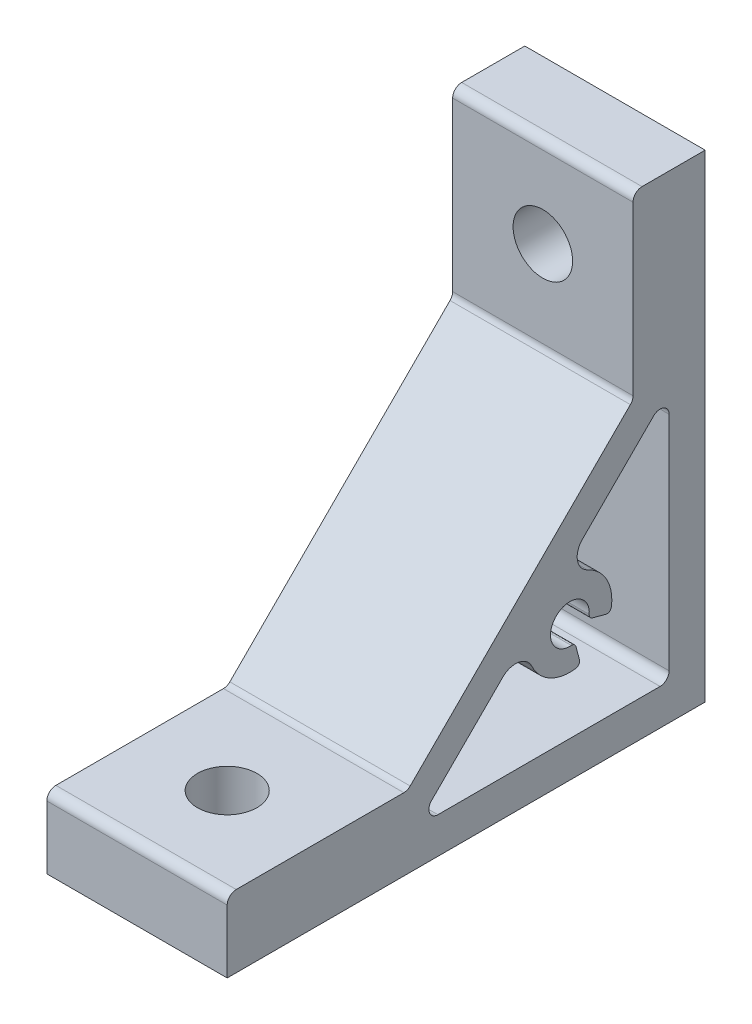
ISO-10303-21;
HEADER;
FILE_DESCRIPTION(('STEP AP214'),'2;1');
FILE_NAME('part.step','',(''),(''),'','','');
FILE_SCHEMA(('AUTOMOTIVE_DESIGN { 1 0 10303 214 1 1 1 1 }'));
ENDSEC;
DATA;
#1=APPLICATION_CONTEXT('core data for automotive mechanical design processes');
#2=APPLICATION_PROTOCOL_DEFINITION('international standard','automotive_design',2000,#1);
#3=PRODUCT_CONTEXT('',#1,'mechanical');
#4=PRODUCT('Part','Part','',(#3));
#5=PRODUCT_RELATED_PRODUCT_CATEGORY('part','',(#4));
#6=PRODUCT_DEFINITION_FORMATION('','',#4);
#7=PRODUCT_DEFINITION_CONTEXT('part definition',#1,'design');
#8=PRODUCT_DEFINITION('design','',#6,#7);
#9=PRODUCT_DEFINITION_SHAPE('','',#8);
#10=(LENGTH_UNIT() NAMED_UNIT(*) SI_UNIT(.MILLI.,.METRE.));
#11=(NAMED_UNIT(*) PLANE_ANGLE_UNIT() SI_UNIT($,.RADIAN.));
#12=(NAMED_UNIT(*) SI_UNIT($,.STERADIAN.) SOLID_ANGLE_UNIT());
#13=UNCERTAINTY_MEASURE_WITH_UNIT(LENGTH_MEASURE(1.E-05),#10,'distance_accuracy_value','');
#14=(GEOMETRIC_REPRESENTATION_CONTEXT(3) GLOBAL_UNCERTAINTY_ASSIGNED_CONTEXT((#13)) GLOBAL_UNIT_ASSIGNED_CONTEXT((#10,
#11,#12)) REPRESENTATION_CONTEXT('',''));
#15=CARTESIAN_POINT('',(0.,0.,0.));
#16=DIRECTION('',(0.,0.,1.));
#17=DIRECTION('',(1.,0.,0.));
#18=AXIS2_PLACEMENT_3D('',#15,#16,#17);
#19=CARTESIAN_POINT('',(10.,51.9999999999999,6.99999999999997));
#20=DIRECTION('',(1.,0.,0.));
#21=DIRECTION('',(0.,0.,-1.));
#22=AXIS2_PLACEMENT_3D('',#19,#20,#21);
#23=PLANE('',#22);
#24=DIRECTION('',(0.,0.,-1.));
#25=VECTOR('',#24,1.);
#26=CARTESIAN_POINT('',(10.,0.,53.));
#27=LINE('',#26,#25);
#28=CARTESIAN_POINT('',(10.,0.,53.));
#29=VERTEX_POINT('',#28);
#30=CARTESIAN_POINT('',(10.,0.,0.));
#31=VERTEX_POINT('',#30);
#32=EDGE_CURVE('E372',#29,#31,#27,.T.);
#33=ORIENTED_EDGE('',*,*,#32,.T.);
#34=DIRECTION('',(0.,1.,0.));
#35=VECTOR('',#34,1.);
#36=CARTESIAN_POINT('',(10.,0.,0.));
#37=LINE('',#36,#35);
#38=CARTESIAN_POINT('',(10.,53.,0.));
#39=VERTEX_POINT('',#38);
#40=EDGE_CURVE('E375',#31,#39,#37,.T.);
#41=ORIENTED_EDGE('',*,*,#40,.T.);
#42=DIRECTION('',(0.,0.,1.));
#43=VECTOR('',#42,1.);
#44=CARTESIAN_POINT('',(10.,52.9999999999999,6.99999999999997));
#45=LINE('',#44,#43);
#46=CARTESIAN_POINT('',(10.,52.9999999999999,6.99999999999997));
#47=VERTEX_POINT('',#46);
#48=EDGE_CURVE('E378',#39,#47,#45,.T.);
#49=ORIENTED_EDGE('',*,*,#48,.T.);
#50=CARTESIAN_POINT('',(10.,51.9999999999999,6.99999999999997));
#51=DIRECTION('',(1.,0.,0.));
#52=DIRECTION('',(0.,0.,-1.));
#53=AXIS2_PLACEMENT_3D('',#50,#51,#52);
#54=CIRCLE('',#53,1.);
#55=CARTESIAN_POINT('',(10.,51.9999999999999,7.99999999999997));
#56=VERTEX_POINT('',#55);
#57=EDGE_CURVE('E380',#47,#56,#54,.T.);
#58=ORIENTED_EDGE('',*,*,#57,.T.);
#59=DIRECTION('',(0.,-1.,0.));
#60=VECTOR('',#59,1.);
#61=CARTESIAN_POINT('',(10.,33.4142135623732,7.99999999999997));
#62=LINE('',#61,#60);
#63=CARTESIAN_POINT('',(10.,33.4142135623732,7.99999999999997));
#64=VERTEX_POINT('',#63);
#65=EDGE_CURVE('E382',#56,#64,#62,.T.);
#66=ORIENTED_EDGE('',*,*,#65,.T.);
#67=CARTESIAN_POINT('',(10.,33.4142135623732,8.99999999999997));
#68=DIRECTION('',(-1.,0.,0.));
#69=DIRECTION('',(0.,0.,-1.));
#70=AXIS2_PLACEMENT_3D('',#67,#68,#69);
#71=CIRCLE('',#70,1.);
#72=CARTESIAN_POINT('',(10.,32.7071067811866,8.29289321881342));
#73=VERTEX_POINT('',#72);
#74=EDGE_CURVE('E384',#64,#73,#71,.T.);
#75=ORIENTED_EDGE('',*,*,#74,.T.);
#76=DIRECTION('',(0.,-0.707106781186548,0.707106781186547));
#77=VECTOR('',#76,1.);
#78=CARTESIAN_POINT('',(10.,32.7071067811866,8.29289321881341));
#79=LINE('',#78,#77);
#80=CARTESIAN_POINT('',(10.,8.29289321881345,32.7071067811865));
#81=VERTEX_POINT('',#80);
#82=EDGE_CURVE('E386',#73,#81,#79,.T.);
#83=ORIENTED_EDGE('',*,*,#82,.T.);
#84=CARTESIAN_POINT('',(10.,8.99999999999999,33.4142135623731));
#85=DIRECTION('',(-1.,0.,0.));
#86=DIRECTION('',(0.,0.,-1.));
#87=AXIS2_PLACEMENT_3D('',#84,#85,#86);
#88=CIRCLE('',#87,1.00000000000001);
#89=CARTESIAN_POINT('',(10.,7.99999999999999,33.4142135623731));
#90=VERTEX_POINT('',#89);
#91=EDGE_CURVE('E389',#81,#90,#88,.T.);
#92=ORIENTED_EDGE('',*,*,#91,.T.);
#93=DIRECTION('',(0.,0.,1.));
#94=VECTOR('',#93,1.);
#95=CARTESIAN_POINT('',(10.,7.99999999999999,52.));
#96=LINE('',#95,#94);
#97=CARTESIAN_POINT('',(10.,7.99999999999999,52.));
#98=VERTEX_POINT('',#97);
#99=EDGE_CURVE('E391',#90,#98,#96,.T.);
#100=ORIENTED_EDGE('',*,*,#99,.T.);
#101=CARTESIAN_POINT('',(10.,6.99999999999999,52.));
#102=DIRECTION('',(1.,0.,0.));
#103=DIRECTION('',(0.,0.,-1.));
#104=AXIS2_PLACEMENT_3D('',#101,#102,#103);
#105=CIRCLE('',#104,1.);
#106=CARTESIAN_POINT('',(10.,6.99999999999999,53.));
#107=VERTEX_POINT('',#106);
#108=EDGE_CURVE('E393',#98,#107,#105,.T.);
#109=ORIENTED_EDGE('',*,*,#108,.T.);
#110=DIRECTION('',(0.,-1.,0.));
#111=VECTOR('',#110,1.);
#112=CARTESIAN_POINT('',(10.,0.,53.));
#113=LINE('',#112,#111);
#114=EDGE_CURVE('E395',#107,#29,#113,.T.);
#115=ORIENTED_EDGE('',*,*,#114,.T.);
#116=EDGE_LOOP('',(#33,#41,#49,#58,#66,#75,#83,#92,#100,#109,#115));
#117=FACE_BOUND('',#116,.T.);
#118=DIRECTION('',(0.,1.,0.));
#119=VECTOR('',#118,1.);
#120=CARTESIAN_POINT('',(10.,4.99999999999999,3.99999999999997));
#121=LINE('',#120,#119);
#122=CARTESIAN_POINT('',(10.,4.99999999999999,3.99999999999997));
#123=VERTEX_POINT('',#122);
#124=CARTESIAN_POINT('',(10.,29.6360389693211,3.99999999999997));
#125=VERTEX_POINT('',#124);
#126=EDGE_CURVE('E243',#123,#125,#121,.T.);
#127=ORIENTED_EDGE('',*,*,#126,.F.);
#128=CARTESIAN_POINT('',(10.,4.99999999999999,4.99999999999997));
#129=DIRECTION('',(1.,0.,0.));
#130=DIRECTION('',(0.,0.,-1.));
#131=AXIS2_PLACEMENT_3D('',#128,#129,#130);
#132=CIRCLE('',#131,0.999999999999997);
#133=CARTESIAN_POINT('',(10.,4.,4.99999999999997));
#134=VERTEX_POINT('',#133);
#135=EDGE_CURVE('E235',#134,#123,#132,.T.);
#136=ORIENTED_EDGE('',*,*,#135,.F.);
#137=DIRECTION('',(0.,0.,-1.));
#138=VECTOR('',#137,1.);
#139=CARTESIAN_POINT('',(10.,4.,29.6360389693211));
#140=LINE('',#139,#138);
#141=CARTESIAN_POINT('',(10.,4.,29.6360389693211));
#142=VERTEX_POINT('',#141);
#143=EDGE_CURVE('E289',#142,#134,#140,.T.);
#144=ORIENTED_EDGE('',*,*,#143,.F.);
#145=CARTESIAN_POINT('',(10.,4.99999999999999,29.6360389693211));
#146=DIRECTION('',(1.,0.,0.));
#147=DIRECTION('',(0.,0.,-1.));
#148=AXIS2_PLACEMENT_3D('',#145,#146,#147);
#149=CIRCLE('',#148,0.99999999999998);
#150=CARTESIAN_POINT('',(10.,5.70710678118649,30.3431457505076));
#151=VERTEX_POINT('',#150);
#152=EDGE_CURVE('E287',#151,#142,#149,.T.);
#153=ORIENTED_EDGE('',*,*,#152,.F.);
#154=DIRECTION('',(0.,-0.707106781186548,0.707106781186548));
#155=VECTOR('',#154,1.);
#156=CARTESIAN_POINT('',(10.,13.6074107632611,22.442841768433));
#157=LINE('',#156,#155);
#158=CARTESIAN_POINT('',(10.,13.6074107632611,22.442841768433));
#159=VERTEX_POINT('',#158);
#160=EDGE_CURVE('E285',#159,#151,#157,.T.);
#161=ORIENTED_EDGE('',*,*,#160,.F.);
#162=CARTESIAN_POINT('',(10.,12.193197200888,21.0286282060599));
#163=DIRECTION('',(1.,0.,0.));
#164=DIRECTION('',(0.,0.,-1.));
#165=AXIS2_PLACEMENT_3D('',#162,#163,#164);
#166=CIRCLE('',#165,1.99999999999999);
#167=CARTESIAN_POINT('',(10.,13.0373484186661,19.2155069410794));
#168=VERTEX_POINT('',#167);
#169=EDGE_CURVE('E283',#168,#159,#166,.T.);
#170=ORIENTED_EDGE('',*,*,#169,.F.);
#171=CARTESIAN_POINT('',(10.,15.,15.));
#172=DIRECTION('',(-1.,0.,0.));
#173=DIRECTION('',(0.,0.,-1.));
#174=AXIS2_PLACEMENT_3D('',#171,#172,#173);
#175=CIRCLE('',#174,4.65000000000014);
#176=CARTESIAN_POINT('',(10.,10.3961625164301,14.3464095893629));
#177=VERTEX_POINT('',#176);
#178=EDGE_CURVE('E281',#177,#168,#175,.T.);
#179=ORIENTED_EDGE('',*,*,#178,.F.);
#180=CARTESIAN_POINT('',(10.,10.891198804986,14.4166881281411));
#181=DIRECTION('',(-1.,0.,0.));
#182=DIRECTION('',(0.,0.,-1.));
#183=AXIS2_PLACEMENT_3D('',#180,#181,#182);
#184=CIRCLE('',#183,0.500000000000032);
#185=CARTESIAN_POINT('',(10.,11.0206083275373,13.9337252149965));
#186=VERTEX_POINT('',#185);
#187=EDGE_CURVE('E279',#186,#177,#184,.T.);
#188=ORIENTED_EDGE('',*,*,#187,.F.);
#189=DIRECTION('',(0.,-0.965925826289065,-0.258819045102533));
#190=VECTOR('',#189,1.);
#191=CARTESIAN_POINT('',(10.,11.0206083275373,13.9337252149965));
#192=LINE('',#191,#190);
#193=CARTESIAN_POINT('',(10.,12.4862719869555,14.3264486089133));
#194=VERTEX_POINT('',#193);
#195=EDGE_CURVE('E277',#194,#186,#192,.T.);
#196=ORIENTED_EDGE('',*,*,#195,.F.);
#197=CARTESIAN_POINT('',(10.,12.3568624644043,14.8094115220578));
#198=DIRECTION('',(-1.,0.,0.));
#199=DIRECTION('',(0.,0.,-1.));
#200=AXIS2_PLACEMENT_3D('',#197,#198,#199);
#201=CIRCLE('',#200,0.499999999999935);
#202=CARTESIAN_POINT('',(10.,12.8555676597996,14.8453716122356));
#203=VERTEX_POINT('',#202);
#204=EDGE_CURVE('E275',#203,#194,#201,.T.);
#205=ORIENTED_EDGE('',*,*,#204,.F.);
#206=CARTESIAN_POINT('',(10.,15.,15.));
#207=DIRECTION('',(1.,0.,0.));
#208=DIRECTION('',(0.,0.,-1.));
#209=AXIS2_PLACEMENT_3D('',#206,#207,#208);
#210=CIRCLE('',#209,2.14999999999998);
#211=CARTESIAN_POINT('',(10.,14.8453716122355,12.8555676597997));
#212=VERTEX_POINT('',#211);
#213=EDGE_CURVE('E273',#212,#203,#210,.T.);
#214=ORIENTED_EDGE('',*,*,#213,.F.);
#215=CARTESIAN_POINT('',(10.,14.8094115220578,12.3568624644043));
#216=DIRECTION('',(-1.,0.,0.));
#217=DIRECTION('',(0.,0.,-1.));
#218=AXIS2_PLACEMENT_3D('',#215,#216,#217);
#219=CIRCLE('',#218,0.499999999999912);
#220=CARTESIAN_POINT('',(10.,14.3264486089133,12.4862719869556));
#221=VERTEX_POINT('',#220);
#222=EDGE_CURVE('E271',#221,#212,#219,.T.);
#223=ORIENTED_EDGE('',*,*,#222,.F.);
#224=DIRECTION('',(0.,0.2588190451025,0.965925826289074));
#225=VECTOR('',#224,1.);
#226=CARTESIAN_POINT('',(10.,13.9337252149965,11.0206083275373));
#227=LINE('',#226,#225);
#228=CARTESIAN_POINT('',(10.,13.9337252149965,11.0206083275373));
#229=VERTEX_POINT('',#228);
#230=EDGE_CURVE('E269',#229,#221,#227,.T.);
#231=ORIENTED_EDGE('',*,*,#230,.F.);
#232=CARTESIAN_POINT('',(10.,14.416688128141,10.891198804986));
#233=DIRECTION('',(-1.,0.,0.));
#234=DIRECTION('',(0.,0.,-1.));
#235=AXIS2_PLACEMENT_3D('',#232,#233,#234);
#236=CIRCLE('',#235,0.499999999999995);
#237=CARTESIAN_POINT('',(10.,14.3464095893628,10.3961625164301));
#238=VERTEX_POINT('',#237);
#239=EDGE_CURVE('E267',#238,#229,#236,.T.);
#240=ORIENTED_EDGE('',*,*,#239,.F.);
#241=CARTESIAN_POINT('',(10.,15.,15.));
#242=DIRECTION('',(-1.,0.,0.));
#243=DIRECTION('',(0.,0.,-1.));
#244=AXIS2_PLACEMENT_3D('',#241,#242,#243);
#245=CIRCLE('',#244,4.64999999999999);
#246=CARTESIAN_POINT('',(10.,19.2155069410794,13.0373484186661));
#247=VERTEX_POINT('',#246);
#248=EDGE_CURVE('E265',#247,#238,#245,.T.);
#249=ORIENTED_EDGE('',*,*,#248,.F.);
#250=CARTESIAN_POINT('',(10.,21.0286282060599,12.193197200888));
#251=DIRECTION('',(1.,0.,0.));
#252=DIRECTION('',(0.,0.,-1.));
#253=AXIS2_PLACEMENT_3D('',#250,#251,#252);
#254=CIRCLE('',#253,2.00000000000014);
#255=CARTESIAN_POINT('',(10.,22.442841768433,13.6074107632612));
#256=VERTEX_POINT('',#255);
#257=EDGE_CURVE('E263',#256,#247,#254,.T.);
#258=ORIENTED_EDGE('',*,*,#257,.F.);
#259=DIRECTION('',(0.,-0.707106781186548,0.707106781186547));
#260=VECTOR('',#259,1.);
#261=CARTESIAN_POINT('',(10.,30.3431457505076,5.70710678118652));
#262=LINE('',#261,#260);
#263=CARTESIAN_POINT('',(10.,30.3431457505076,5.70710678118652));
#264=VERTEX_POINT('',#263);
#265=EDGE_CURVE('E258',#264,#256,#262,.T.);
#266=ORIENTED_EDGE('',*,*,#265,.F.);
#267=CARTESIAN_POINT('',(10.,29.6360389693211,4.99999999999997));
#268=DIRECTION('',(1.,0.,0.));
#269=DIRECTION('',(0.,0.,-1.));
#270=AXIS2_PLACEMENT_3D('',#267,#268,#269);
#271=CIRCLE('',#270,1.00000000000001);
#272=EDGE_CURVE('E256',#125,#264,#271,.T.);
#273=ORIENTED_EDGE('',*,*,#272,.F.);
#274=EDGE_LOOP('',(#127,#136,#144,#153,#161,#170,#179,#188,#196,#205,#214,#223,#231,#240,#249,
#258,#266,#273));
#275=FACE_BOUND('',#274,.T.);
#276=ADVANCED_FACE('F44',(#117,#275),#23,.T.);
#277=CARTESIAN_POINT('',(-10.,51.9999999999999,6.99999999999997));
#278=DIRECTION('',(1.,0.,0.));
#279=DIRECTION('',(0.,0.,-1.));
#280=AXIS2_PLACEMENT_3D('',#277,#278,#279);
#281=PLANE('',#280);
#282=DIRECTION('',(0.,0.,-1.));
#283=VECTOR('',#282,1.);
#284=CARTESIAN_POINT('',(-10.,0.,53.));
#285=LINE('',#284,#283);
#286=CARTESIAN_POINT('',(-10.,0.,53.));
#287=VERTEX_POINT('',#286);
#288=CARTESIAN_POINT('',(-10.,0.,0.));
#289=VERTEX_POINT('',#288);
#290=EDGE_CURVE('E251',#287,#289,#285,.T.);
#291=ORIENTED_EDGE('',*,*,#290,.F.);
#292=DIRECTION('',(0.,-1.,0.));
#293=VECTOR('',#292,1.);
#294=CARTESIAN_POINT('',(-10.,0.,53.));
#295=LINE('',#294,#293);
#296=CARTESIAN_POINT('',(-10.,6.99999999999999,53.));
#297=VERTEX_POINT('',#296);
#298=EDGE_CURVE('E376',#297,#287,#295,.T.);
#299=ORIENTED_EDGE('',*,*,#298,.F.);
#300=CARTESIAN_POINT('',(-10.,6.99999999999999,52.));
#301=DIRECTION('',(1.,0.,0.));
#302=DIRECTION('',(0.,0.,-1.));
#303=AXIS2_PLACEMENT_3D('',#300,#301,#302);
#304=CIRCLE('',#303,1.);
#305=CARTESIAN_POINT('',(-10.,7.99999999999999,52.));
#306=VERTEX_POINT('',#305);
#307=EDGE_CURVE('E416',#306,#297,#304,.T.);
#308=ORIENTED_EDGE('',*,*,#307,.F.);
#309=DIRECTION('',(0.,0.,1.));
#310=VECTOR('',#309,1.);
#311=CARTESIAN_POINT('',(-10.,7.99999999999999,52.));
#312=LINE('',#311,#310);
#313=CARTESIAN_POINT('',(-10.,7.99999999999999,33.4142135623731));
#314=VERTEX_POINT('',#313);
#315=EDGE_CURVE('E414',#314,#306,#312,.T.);
#316=ORIENTED_EDGE('',*,*,#315,.F.);
#317=CARTESIAN_POINT('',(-10.,8.99999999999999,33.4142135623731));
#318=DIRECTION('',(-1.,0.,0.));
#319=DIRECTION('',(0.,0.,-1.));
#320=AXIS2_PLACEMENT_3D('',#317,#318,#319);
#321=CIRCLE('',#320,1.00000000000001);
#322=CARTESIAN_POINT('',(-10.,8.29289321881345,32.7071067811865));
#323=VERTEX_POINT('',#322);
#324=EDGE_CURVE('E412',#323,#314,#321,.T.);
#325=ORIENTED_EDGE('',*,*,#324,.F.);
#326=DIRECTION('',(0.,-0.707106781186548,0.707106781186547));
#327=VECTOR('',#326,1.);
#328=CARTESIAN_POINT('',(-10.,32.7071067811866,8.29289321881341));
#329=LINE('',#328,#327);
#330=CARTESIAN_POINT('',(-10.,32.7071067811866,8.29289321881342));
#331=VERTEX_POINT('',#330);
#332=EDGE_CURVE('E410',#331,#323,#329,.T.);
#333=ORIENTED_EDGE('',*,*,#332,.F.);
#334=CARTESIAN_POINT('',(-10.,33.4142135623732,8.99999999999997));
#335=DIRECTION('',(-1.,0.,0.));
#336=DIRECTION('',(0.,0.,-1.));
#337=AXIS2_PLACEMENT_3D('',#334,#335,#336);
#338=CIRCLE('',#337,1.);
#339=CARTESIAN_POINT('',(-10.,33.4142135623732,7.99999999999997));
#340=VERTEX_POINT('',#339);
#341=EDGE_CURVE('E408',#340,#331,#338,.T.);
#342=ORIENTED_EDGE('',*,*,#341,.F.);
#343=DIRECTION('',(0.,-1.,0.));
#344=VECTOR('',#343,1.);
#345=CARTESIAN_POINT('',(-10.,33.4142135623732,7.99999999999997));
#346=LINE('',#345,#344);
#347=CARTESIAN_POINT('',(-10.,51.9999999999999,7.99999999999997));
#348=VERTEX_POINT('',#347);
#349=EDGE_CURVE('E406',#348,#340,#346,.T.);
#350=ORIENTED_EDGE('',*,*,#349,.F.);
#351=CARTESIAN_POINT('',(-10.,51.9999999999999,6.99999999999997));
#352=DIRECTION('',(1.,0.,0.));
#353=DIRECTION('',(0.,0.,-1.));
#354=AXIS2_PLACEMENT_3D('',#351,#352,#353);
#355=CIRCLE('',#354,1.);
#356=CARTESIAN_POINT('',(-10.,52.9999999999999,6.99999999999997));
#357=VERTEX_POINT('',#356);
#358=EDGE_CURVE('E404',#357,#348,#355,.T.);
#359=ORIENTED_EDGE('',*,*,#358,.F.);
#360=DIRECTION('',(0.,0.,1.));
#361=VECTOR('',#360,1.);
#362=CARTESIAN_POINT('',(-10.,52.9999999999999,6.99999999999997));
#363=LINE('',#362,#361);
#364=CARTESIAN_POINT('',(-10.,53.,0.));
#365=VERTEX_POINT('',#364);
#366=EDGE_CURVE('E402',#365,#357,#363,.T.);
#367=ORIENTED_EDGE('',*,*,#366,.F.);
#368=DIRECTION('',(0.,1.,0.));
#369=VECTOR('',#368,1.);
#370=CARTESIAN_POINT('',(-10.,0.,0.));
#371=LINE('',#370,#369);
#372=EDGE_CURVE('E400',#289,#365,#371,.T.);
#373=ORIENTED_EDGE('',*,*,#372,.F.);
#374=EDGE_LOOP('',(#291,#299,#308,#316,#325,#333,#342,#350,#359,#367,#373));
#375=FACE_BOUND('',#374,.T.);
#376=CARTESIAN_POINT('',(-10.,4.99999999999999,4.99999999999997));
#377=DIRECTION('',(1.,0.,0.));
#378=DIRECTION('',(0.,0.,-1.));
#379=AXIS2_PLACEMENT_3D('',#376,#377,#378);
#380=CIRCLE('',#379,0.999999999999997);
#381=CARTESIAN_POINT('',(-10.,4.,4.99999999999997));
#382=VERTEX_POINT('',#381);
#383=CARTESIAN_POINT('',(-10.,4.99999999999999,3.99999999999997));
#384=VERTEX_POINT('',#383);
#385=EDGE_CURVE('E67',#382,#384,#380,.T.);
#386=ORIENTED_EDGE('',*,*,#385,.T.);
#387=DIRECTION('',(0.,1.,0.));
#388=VECTOR('',#387,1.);
#389=CARTESIAN_POINT('',(-10.,4.99999999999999,3.99999999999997));
#390=LINE('',#389,#388);
#391=CARTESIAN_POINT('',(-10.,29.6360389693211,3.99999999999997));
#392=VERTEX_POINT('',#391);
#393=EDGE_CURVE('E250',#384,#392,#390,.T.);
#394=ORIENTED_EDGE('',*,*,#393,.T.);
#395=CARTESIAN_POINT('',(-10.,29.6360389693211,4.99999999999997));
#396=DIRECTION('',(1.,0.,0.));
#397=DIRECTION('',(0.,0.,-1.));
#398=AXIS2_PLACEMENT_3D('',#395,#396,#397);
#399=CIRCLE('',#398,1.00000000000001);
#400=CARTESIAN_POINT('',(-10.,30.3431457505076,5.70710678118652));
#401=VERTEX_POINT('',#400);
#402=EDGE_CURVE('E294',#392,#401,#399,.T.);
#403=ORIENTED_EDGE('',*,*,#402,.T.);
#404=DIRECTION('',(0.,-0.707106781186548,0.707106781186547));
#405=VECTOR('',#404,1.);
#406=CARTESIAN_POINT('',(-10.,30.3431457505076,5.70710678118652));
#407=LINE('',#406,#405);
#408=CARTESIAN_POINT('',(-10.,22.442841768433,13.6074107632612));
#409=VERTEX_POINT('',#408);
#410=EDGE_CURVE('E297',#401,#409,#407,.T.);
#411=ORIENTED_EDGE('',*,*,#410,.T.);
#412=CARTESIAN_POINT('',(-10.,21.0286282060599,12.193197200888));
#413=DIRECTION('',(1.,0.,0.));
#414=DIRECTION('',(0.,0.,-1.));
#415=AXIS2_PLACEMENT_3D('',#412,#413,#414);
#416=CIRCLE('',#415,2.00000000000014);
#417=CARTESIAN_POINT('',(-10.,19.2155069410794,13.0373484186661));
#418=VERTEX_POINT('',#417);
#419=EDGE_CURVE('E300',#409,#418,#416,.T.);
#420=ORIENTED_EDGE('',*,*,#419,.T.);
#421=CARTESIAN_POINT('',(-10.,15.,15.));
#422=DIRECTION('',(-1.,0.,0.));
#423=DIRECTION('',(0.,0.,-1.));
#424=AXIS2_PLACEMENT_3D('',#421,#422,#423);
#425=CIRCLE('',#424,4.64999999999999);
#426=CARTESIAN_POINT('',(-10.,14.3464095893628,10.3961625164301));
#427=VERTEX_POINT('',#426);
#428=EDGE_CURVE('E303',#418,#427,#425,.T.);
#429=ORIENTED_EDGE('',*,*,#428,.T.);
#430=CARTESIAN_POINT('',(-10.,14.416688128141,10.891198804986));
#431=DIRECTION('',(-1.,0.,0.));
#432=DIRECTION('',(0.,0.,-1.));
#433=AXIS2_PLACEMENT_3D('',#430,#431,#432);
#434=CIRCLE('',#433,0.499999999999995);
#435=CARTESIAN_POINT('',(-10.,13.9337252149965,11.0206083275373));
#436=VERTEX_POINT('',#435);
#437=EDGE_CURVE('E306',#427,#436,#434,.T.);
#438=ORIENTED_EDGE('',*,*,#437,.T.);
#439=DIRECTION('',(0.,0.2588190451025,0.965925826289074));
#440=VECTOR('',#439,1.);
#441=CARTESIAN_POINT('',(-10.,13.9337252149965,11.0206083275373));
#442=LINE('',#441,#440);
#443=CARTESIAN_POINT('',(-10.,14.3264486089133,12.4862719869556));
#444=VERTEX_POINT('',#443);
#445=EDGE_CURVE('E309',#436,#444,#442,.T.);
#446=ORIENTED_EDGE('',*,*,#445,.T.);
#447=CARTESIAN_POINT('',(-10.,14.8094115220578,12.3568624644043));
#448=DIRECTION('',(-1.,0.,0.));
#449=DIRECTION('',(0.,0.,-1.));
#450=AXIS2_PLACEMENT_3D('',#447,#448,#449);
#451=CIRCLE('',#450,0.499999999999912);
#452=CARTESIAN_POINT('',(-10.,14.8453716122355,12.8555676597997));
#453=VERTEX_POINT('',#452);
#454=EDGE_CURVE('E312',#444,#453,#451,.T.);
#455=ORIENTED_EDGE('',*,*,#454,.T.);
#456=CARTESIAN_POINT('',(-10.,15.,15.));
#457=DIRECTION('',(1.,0.,0.));
#458=DIRECTION('',(0.,0.,-1.));
#459=AXIS2_PLACEMENT_3D('',#456,#457,#458);
#460=CIRCLE('',#459,2.14999999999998);
#461=CARTESIAN_POINT('',(-10.,12.8555676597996,14.8453716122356));
#462=VERTEX_POINT('',#461);
#463=EDGE_CURVE('E315',#453,#462,#460,.T.);
#464=ORIENTED_EDGE('',*,*,#463,.T.);
#465=CARTESIAN_POINT('',(-10.,12.3568624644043,14.8094115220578));
#466=DIRECTION('',(-1.,0.,0.));
#467=DIRECTION('',(0.,0.,-1.));
#468=AXIS2_PLACEMENT_3D('',#465,#466,#467);
#469=CIRCLE('',#468,0.499999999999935);
#470=CARTESIAN_POINT('',(-10.,12.4862719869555,14.3264486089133));
#471=VERTEX_POINT('',#470);
#472=EDGE_CURVE('E318',#462,#471,#469,.T.);
#473=ORIENTED_EDGE('',*,*,#472,.T.);
#474=DIRECTION('',(0.,-0.965925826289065,-0.258819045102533));
#475=VECTOR('',#474,1.);
#476=CARTESIAN_POINT('',(-10.,11.0206083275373,13.9337252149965));
#477=LINE('',#476,#475);
#478=CARTESIAN_POINT('',(-10.,11.0206083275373,13.9337252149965));
#479=VERTEX_POINT('',#478);
#480=EDGE_CURVE('E321',#471,#479,#477,.T.);
#481=ORIENTED_EDGE('',*,*,#480,.T.);
#482=CARTESIAN_POINT('',(-10.,10.891198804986,14.4166881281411));
#483=DIRECTION('',(-1.,0.,0.));
#484=DIRECTION('',(0.,0.,-1.));
#485=AXIS2_PLACEMENT_3D('',#482,#483,#484);
#486=CIRCLE('',#485,0.500000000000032);
#487=CARTESIAN_POINT('',(-10.,10.3961625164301,14.3464095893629));
#488=VERTEX_POINT('',#487);
#489=EDGE_CURVE('E324',#479,#488,#486,.T.);
#490=ORIENTED_EDGE('',*,*,#489,.T.);
#491=CARTESIAN_POINT('',(-10.,15.,15.));
#492=DIRECTION('',(-1.,0.,0.));
#493=DIRECTION('',(0.,0.,-1.));
#494=AXIS2_PLACEMENT_3D('',#491,#492,#493);
#495=CIRCLE('',#494,4.65000000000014);
#496=CARTESIAN_POINT('',(-10.,13.0373484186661,19.2155069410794));
#497=VERTEX_POINT('',#496);
#498=EDGE_CURVE('E327',#488,#497,#495,.T.);
#499=ORIENTED_EDGE('',*,*,#498,.T.);
#500=CARTESIAN_POINT('',(-10.,12.193197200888,21.0286282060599));
#501=DIRECTION('',(1.,0.,0.));
#502=DIRECTION('',(0.,0.,-1.));
#503=AXIS2_PLACEMENT_3D('',#500,#501,#502);
#504=CIRCLE('',#503,1.99999999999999);
#505=CARTESIAN_POINT('',(-10.,13.6074107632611,22.442841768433));
#506=VERTEX_POINT('',#505);
#507=EDGE_CURVE('E330',#497,#506,#504,.T.);
#508=ORIENTED_EDGE('',*,*,#507,.T.);
#509=DIRECTION('',(0.,-0.707106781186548,0.707106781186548));
#510=VECTOR('',#509,1.);
#511=CARTESIAN_POINT('',(-10.,13.6074107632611,22.442841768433));
#512=LINE('',#511,#510);
#513=CARTESIAN_POINT('',(-10.,5.70710678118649,30.3431457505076));
#514=VERTEX_POINT('',#513);
#515=EDGE_CURVE('E333',#506,#514,#512,.T.);
#516=ORIENTED_EDGE('',*,*,#515,.T.);
#517=CARTESIAN_POINT('',(-10.,4.99999999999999,29.6360389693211));
#518=DIRECTION('',(1.,0.,0.));
#519=DIRECTION('',(0.,0.,-1.));
#520=AXIS2_PLACEMENT_3D('',#517,#518,#519);
#521=CIRCLE('',#520,0.99999999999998);
#522=CARTESIAN_POINT('',(-10.,4.00000000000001,29.6360389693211));
#523=VERTEX_POINT('',#522);
#524=EDGE_CURVE('E336',#514,#523,#521,.T.);
#525=ORIENTED_EDGE('',*,*,#524,.T.);
#526=DIRECTION('',(0.,0.,-1.));
#527=VECTOR('',#526,1.);
#528=CARTESIAN_POINT('',(-10.,4.,29.6360389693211));
#529=LINE('',#528,#527);
#530=EDGE_CURVE('E244',#523,#382,#529,.T.);
#531=ORIENTED_EDGE('',*,*,#530,.T.);
#532=EDGE_LOOP('',(#386,#394,#403,#411,#420,#429,#438,#446,#455,#464,#473,#481,#490,#499,#508,
#516,#525,#531));
#533=FACE_BOUND('',#532,.T.);
#534=ADVANCED_FACE('F455',(#375,#533),#281,.F.);
#535=CARTESIAN_POINT('',(10.,0.,53.));
#536=DIRECTION('',(0.,1.,0.));
#537=DIRECTION('',(0.,0.,1.));
#538=AXIS2_PLACEMENT_3D('',#535,#536,#537);
#539=PLANE('',#538);
#540=CARTESIAN_POINT('',(0.,0.,43.));
#541=DIRECTION('',(0.,1.,0.));
#542=DIRECTION('',(0.,0.,1.));
#543=AXIS2_PLACEMENT_3D('',#540,#541,#542);
#544=CIRCLE('',#543,3.29999999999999);
#545=CARTESIAN_POINT('',(0.,0.,46.3));
#546=VERTEX_POINT('',#545);
#547=EDGE_CURVE('E292',#546,#546,#544,.T.);
#548=ORIENTED_EDGE('',*,*,#547,.T.);
#549=EDGE_LOOP('',(#548));
#550=FACE_BOUND('',#549,.T.);
#551=ORIENTED_EDGE('',*,*,#290,.T.);
#552=DIRECTION('',(-1.,0.,0.));
#553=VECTOR('',#552,1.);
#554=CARTESIAN_POINT('',(10.,0.,0.));
#555=LINE('',#554,#553);
#556=EDGE_CURVE('E12',#31,#289,#555,.T.);
#557=ORIENTED_EDGE('',*,*,#556,.F.);
#558=ORIENTED_EDGE('',*,*,#32,.F.);
#559=DIRECTION('',(-1.,0.,0.));
#560=VECTOR('',#559,1.);
#561=CARTESIAN_POINT('',(10.,0.,53.));
#562=LINE('',#561,#560);
#563=EDGE_CURVE('E397',#29,#287,#562,.T.);
#564=ORIENTED_EDGE('',*,*,#563,.T.);
#565=EDGE_LOOP('',(#551,#557,#558,#564));
#566=FACE_BOUND('',#565,.T.);
#567=ADVANCED_FACE('F46',(#550,#566),#539,.F.);
#568=CARTESIAN_POINT('',(10.,0.,0.));
#569=DIRECTION('',(0.,0.,1.));
#570=DIRECTION('',(1.,0.,0.));
#571=AXIS2_PLACEMENT_3D('',#568,#569,#570);
#572=PLANE('',#571);
#573=CARTESIAN_POINT('',(0.,42.9999999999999,0.));
#574=DIRECTION('',(0.,0.,1.));
#575=DIRECTION('',(1.,0.,0.));
#576=AXIS2_PLACEMENT_3D('',#573,#574,#575);
#577=CIRCLE('',#576,3.29999999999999);
#578=CARTESIAN_POINT('',(3.29999999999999,42.9999999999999,0.));
#579=VERTEX_POINT('',#578);
#580=EDGE_CURVE('E806',#579,#579,#577,.T.);
#581=ORIENTED_EDGE('',*,*,#580,.T.);
#582=EDGE_LOOP('',(#581));
#583=FACE_BOUND('',#582,.T.);
#584=ORIENTED_EDGE('',*,*,#372,.T.);
#585=DIRECTION('',(-1.,0.,0.));
#586=VECTOR('',#585,1.);
#587=CARTESIAN_POINT('',(10.,53.,0.));
#588=LINE('',#587,#586);
#589=EDGE_CURVE('E52',#39,#365,#588,.T.);
#590=ORIENTED_EDGE('',*,*,#589,.F.);
#591=ORIENTED_EDGE('',*,*,#40,.F.);
#592=ORIENTED_EDGE('',*,*,#556,.T.);
#593=EDGE_LOOP('',(#584,#590,#591,#592));
#594=FACE_BOUND('',#593,.T.);
#595=ADVANCED_FACE('F472',(#583,#594),#572,.F.);
#596=CARTESIAN_POINT('',(10.,52.9999999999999,6.99999999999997));
#597=DIRECTION('',(0.,-1.,0.));
#598=DIRECTION('',(0.,0.,-1.));
#599=AXIS2_PLACEMENT_3D('',#596,#597,#598);
#600=PLANE('',#599);
#601=ORIENTED_EDGE('',*,*,#366,.T.);
#602=DIRECTION('',(-1.,0.,0.));
#603=VECTOR('',#602,1.);
#604=CARTESIAN_POINT('',(10.,52.9999999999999,6.99999999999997));
#605=LINE('',#604,#603);
#606=EDGE_CURVE('E442',#47,#357,#605,.T.);
#607=ORIENTED_EDGE('',*,*,#606,.F.);
#608=ORIENTED_EDGE('',*,*,#48,.F.);
#609=ORIENTED_EDGE('',*,*,#589,.T.);
#610=EDGE_LOOP('',(#601,#607,#608,#609));
#611=FACE_BOUND('',#610,.T.);
#612=ADVANCED_FACE('F449',(#611),#600,.F.);
#613=CARTESIAN_POINT('',(10.,51.9999999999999,6.99999999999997));
#614=DIRECTION('',(-1.,0.,0.));
#615=DIRECTION('',(0.,0.,1.));
#616=AXIS2_PLACEMENT_3D('',#613,#614,#615);
#617=CYLINDRICAL_SURFACE('',#616,1.);
#618=ORIENTED_EDGE('',*,*,#358,.T.);
#619=DIRECTION('',(-1.,0.,0.));
#620=VECTOR('',#619,1.);
#621=CARTESIAN_POINT('',(10.,51.9999999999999,7.99999999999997));
#622=LINE('',#621,#620);
#623=EDGE_CURVE('E439',#56,#348,#622,.T.);
#624=ORIENTED_EDGE('',*,*,#623,.F.);
#625=ORIENTED_EDGE('',*,*,#57,.F.);
#626=ORIENTED_EDGE('',*,*,#606,.T.);
#627=EDGE_LOOP('',(#618,#624,#625,#626));
#628=FACE_BOUND('',#627,.T.);
#629=ADVANCED_FACE('F461',(#628),#617,.T.);
#630=CARTESIAN_POINT('',(10.,33.4142135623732,7.99999999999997));
#631=DIRECTION('',(0.,0.,-1.));
#632=DIRECTION('',(-1.,0.,0.));
#633=AXIS2_PLACEMENT_3D('',#630,#631,#632);
#634=PLANE('',#633);
#635=CARTESIAN_POINT('',(0.,42.9999999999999,7.99999999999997));
#636=DIRECTION('',(0.,0.,1.));
#637=DIRECTION('',(1.,0.,0.));
#638=AXIS2_PLACEMENT_3D('',#635,#636,#637);
#639=CIRCLE('',#638,3.29999999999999);
#640=CARTESIAN_POINT('',(3.29999999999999,42.9999999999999,7.99999999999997));
#641=VERTEX_POINT('',#640);
#642=EDGE_CURVE('E811',#641,#641,#639,.T.);
#643=ORIENTED_EDGE('',*,*,#642,.F.);
#644=EDGE_LOOP('',(#643));
#645=FACE_BOUND('',#644,.T.);
#646=ORIENTED_EDGE('',*,*,#349,.T.);
#647=DIRECTION('',(-1.,0.,0.));
#648=VECTOR('',#647,1.);
#649=CARTESIAN_POINT('',(10.,33.4142135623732,7.99999999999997));
#650=LINE('',#649,#648);
#651=EDGE_CURVE('E436',#64,#340,#650,.T.);
#652=ORIENTED_EDGE('',*,*,#651,.F.);
#653=ORIENTED_EDGE('',*,*,#65,.F.);
#654=ORIENTED_EDGE('',*,*,#623,.T.);
#655=EDGE_LOOP('',(#646,#652,#653,#654));
#656=FACE_BOUND('',#655,.T.);
#657=ADVANCED_FACE('F465',(#645,#656),#634,.F.);
#658=CARTESIAN_POINT('',(10.,33.4142135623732,8.99999999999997));
#659=DIRECTION('',(-1.,0.,0.));
#660=DIRECTION('',(0.,0.,1.));
#661=AXIS2_PLACEMENT_3D('',#658,#659,#660);
#662=CYLINDRICAL_SURFACE('',#661,1.);
#663=ORIENTED_EDGE('',*,*,#341,.T.);
#664=DIRECTION('',(-1.,0.,0.));
#665=VECTOR('',#664,1.);
#666=CARTESIAN_POINT('',(10.,32.7071067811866,8.29289321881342));
#667=LINE('',#666,#665);
#668=EDGE_CURVE('E433',#73,#331,#667,.T.);
#669=ORIENTED_EDGE('',*,*,#668,.F.);
#670=ORIENTED_EDGE('',*,*,#74,.F.);
#671=ORIENTED_EDGE('',*,*,#651,.T.);
#672=EDGE_LOOP('',(#663,#669,#670,#671));
#673=FACE_BOUND('',#672,.T.);
#674=ADVANCED_FACE('F500',(#673),#662,.F.);
#675=CARTESIAN_POINT('',(10.,32.7071067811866,8.29289321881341));
#676=DIRECTION('',(0.,-0.707106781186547,-0.707106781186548));
#677=DIRECTION('',(0.,0.707106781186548,-0.707106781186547));
#678=AXIS2_PLACEMENT_3D('',#675,#676,#677);
#679=PLANE('',#678);
#680=ORIENTED_EDGE('',*,*,#332,.T.);
#681=DIRECTION('',(-1.,0.,0.));
#682=VECTOR('',#681,1.);
#683=CARTESIAN_POINT('',(10.,8.29289321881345,32.7071067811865));
#684=LINE('',#683,#682);
#685=EDGE_CURVE('E430',#81,#323,#684,.T.);
#686=ORIENTED_EDGE('',*,*,#685,.F.);
#687=ORIENTED_EDGE('',*,*,#82,.F.);
#688=ORIENTED_EDGE('',*,*,#668,.T.);
#689=EDGE_LOOP('',(#680,#686,#687,#688));
#690=FACE_BOUND('',#689,.T.);
#691=ADVANCED_FACE('F498',(#690),#679,.F.);
#692=CARTESIAN_POINT('',(10.,8.99999999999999,33.4142135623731));
#693=DIRECTION('',(-1.,0.,0.));
#694=DIRECTION('',(0.,0.,1.));
#695=AXIS2_PLACEMENT_3D('',#692,#693,#694);
#696=CYLINDRICAL_SURFACE('',#695,1.00000000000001);
#697=ORIENTED_EDGE('',*,*,#324,.T.);
#698=DIRECTION('',(-1.,0.,0.));
#699=VECTOR('',#698,1.);
#700=CARTESIAN_POINT('',(10.,7.99999999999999,33.4142135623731));
#701=LINE('',#700,#699);
#702=EDGE_CURVE('E427',#90,#314,#701,.T.);
#703=ORIENTED_EDGE('',*,*,#702,.F.);
#704=ORIENTED_EDGE('',*,*,#91,.F.);
#705=ORIENTED_EDGE('',*,*,#685,.T.);
#706=EDGE_LOOP('',(#697,#703,#704,#705));
#707=FACE_BOUND('',#706,.T.);
#708=ADVANCED_FACE('F493',(#707),#696,.F.);
#709=CARTESIAN_POINT('',(10.,7.99999999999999,52.));
#710=DIRECTION('',(0.,-1.,0.));
#711=DIRECTION('',(0.,0.,-1.));
#712=AXIS2_PLACEMENT_3D('',#709,#710,#711);
#713=PLANE('',#712);
#714=CARTESIAN_POINT('',(0.,7.99999999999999,43.));
#715=DIRECTION('',(0.,1.,0.));
#716=DIRECTION('',(0.,0.,1.));
#717=AXIS2_PLACEMENT_3D('',#714,#715,#716);
#718=CIRCLE('',#717,3.29999999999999);
#719=CARTESIAN_POINT('',(0.,7.99999999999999,46.3));
#720=VERTEX_POINT('',#719);
#721=EDGE_CURVE('E804',#720,#720,#718,.T.);
#722=ORIENTED_EDGE('',*,*,#721,.F.);
#723=EDGE_LOOP('',(#722));
#724=FACE_BOUND('',#723,.T.);
#725=ORIENTED_EDGE('',*,*,#315,.T.);
#726=DIRECTION('',(-1.,0.,0.));
#727=VECTOR('',#726,1.);
#728=CARTESIAN_POINT('',(10.,7.99999999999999,52.));
#729=LINE('',#728,#727);
#730=EDGE_CURVE('E424',#98,#306,#729,.T.);
#731=ORIENTED_EDGE('',*,*,#730,.F.);
#732=ORIENTED_EDGE('',*,*,#99,.F.);
#733=ORIENTED_EDGE('',*,*,#702,.T.);
#734=EDGE_LOOP('',(#725,#731,#732,#733));
#735=FACE_BOUND('',#734,.T.);
#736=ADVANCED_FACE('F488',(#724,#735),#713,.F.);
#737=CARTESIAN_POINT('',(10.,6.99999999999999,52.));
#738=DIRECTION('',(-1.,0.,0.));
#739=DIRECTION('',(0.,0.,1.));
#740=AXIS2_PLACEMENT_3D('',#737,#738,#739);
#741=CYLINDRICAL_SURFACE('',#740,1.);
#742=ORIENTED_EDGE('',*,*,#307,.T.);
#743=DIRECTION('',(-1.,0.,0.));
#744=VECTOR('',#743,1.);
#745=CARTESIAN_POINT('',(10.,6.99999999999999,53.));
#746=LINE('',#745,#744);
#747=EDGE_CURVE('E421',#107,#297,#746,.T.);
#748=ORIENTED_EDGE('',*,*,#747,.F.);
#749=ORIENTED_EDGE('',*,*,#108,.F.);
#750=ORIENTED_EDGE('',*,*,#730,.T.);
#751=EDGE_LOOP('',(#742,#748,#749,#750));
#752=FACE_BOUND('',#751,.T.);
#753=ADVANCED_FACE('F484',(#752),#741,.T.);
#754=CARTESIAN_POINT('',(10.,0.,53.));
#755=DIRECTION('',(0.,0.,-1.));
#756=DIRECTION('',(-1.,0.,0.));
#757=AXIS2_PLACEMENT_3D('',#754,#755,#756);
#758=PLANE('',#757);
#759=ORIENTED_EDGE('',*,*,#298,.T.);
#760=ORIENTED_EDGE('',*,*,#563,.F.);
#761=ORIENTED_EDGE('',*,*,#114,.F.);
#762=ORIENTED_EDGE('',*,*,#747,.T.);
#763=EDGE_LOOP('',(#759,#760,#761,#762));
#764=FACE_BOUND('',#763,.T.);
#765=ADVANCED_FACE('F479',(#764),#758,.F.);
#766=CARTESIAN_POINT('',(10.,4.99999999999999,4.99999999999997));
#767=DIRECTION('',(-1.,0.,0.));
#768=DIRECTION('',(0.,0.,1.));
#769=AXIS2_PLACEMENT_3D('',#766,#767,#768);
#770=CYLINDRICAL_SURFACE('',#769,0.999999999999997);
#771=ORIENTED_EDGE('',*,*,#385,.F.);
#772=DIRECTION('',(-1.,0.,0.));
#773=VECTOR('',#772,1.);
#774=CARTESIAN_POINT('',(10.,4.,4.99999999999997));
#775=LINE('',#774,#773);
#776=EDGE_CURVE('E239',#134,#382,#775,.T.);
#777=ORIENTED_EDGE('',*,*,#776,.F.);
#778=ORIENTED_EDGE('',*,*,#135,.T.);
#779=DIRECTION('',(-1.,0.,0.));
#780=VECTOR('',#779,1.);
#781=CARTESIAN_POINT('',(10.,4.99999999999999,3.99999999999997));
#782=LINE('',#781,#780);
#783=EDGE_CURVE('E238',#123,#384,#782,.T.);
#784=ORIENTED_EDGE('',*,*,#783,.T.);
#785=EDGE_LOOP('',(#771,#777,#778,#784));
#786=FACE_BOUND('',#785,.T.);
#787=ADVANCED_FACE('F237',(#786),#770,.F.);
#788=CARTESIAN_POINT('',(10.,4.99999999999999,3.99999999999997));
#789=DIRECTION('',(0.,0.,1.));
#790=DIRECTION('',(1.,0.,0.));
#791=AXIS2_PLACEMENT_3D('',#788,#789,#790);
#792=PLANE('',#791);
#793=ORIENTED_EDGE('',*,*,#393,.F.);
#794=ORIENTED_EDGE('',*,*,#783,.F.);
#795=ORIENTED_EDGE('',*,*,#126,.T.);
#796=DIRECTION('',(-1.,0.,0.));
#797=VECTOR('',#796,1.);
#798=CARTESIAN_POINT('',(10.,29.6360389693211,3.99999999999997));
#799=LINE('',#798,#797);
#800=EDGE_CURVE('E252',#125,#392,#799,.T.);
#801=ORIENTED_EDGE('',*,*,#800,.T.);
#802=EDGE_LOOP('',(#793,#794,#795,#801));
#803=FACE_BOUND('',#802,.T.);
#804=ADVANCED_FACE('F247',(#803),#792,.T.);
#805=CARTESIAN_POINT('',(10.,29.6360389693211,4.99999999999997));
#806=DIRECTION('',(-1.,0.,0.));
#807=DIRECTION('',(0.,0.,1.));
#808=AXIS2_PLACEMENT_3D('',#805,#806,#807);
#809=CYLINDRICAL_SURFACE('',#808,1.00000000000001);
#810=ORIENTED_EDGE('',*,*,#402,.F.);
#811=ORIENTED_EDGE('',*,*,#800,.F.);
#812=ORIENTED_EDGE('',*,*,#272,.T.);
#813=DIRECTION('',(-1.,0.,0.));
#814=VECTOR('',#813,1.);
#815=CARTESIAN_POINT('',(10.,30.3431457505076,5.70710678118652));
#816=LINE('',#815,#814);
#817=EDGE_CURVE('E369',#264,#401,#816,.T.);
#818=ORIENTED_EDGE('',*,*,#817,.T.);
#819=EDGE_LOOP('',(#810,#811,#812,#818));
#820=FACE_BOUND('',#819,.T.);
#821=ADVANCED_FACE('F556',(#820),#809,.F.);
#822=CARTESIAN_POINT('',(10.,30.3431457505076,5.70710678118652));
#823=DIRECTION('',(0.,-0.707106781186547,-0.707106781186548));
#824=DIRECTION('',(0.,0.707106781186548,-0.707106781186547));
#825=AXIS2_PLACEMENT_3D('',#822,#823,#824);
#826=PLANE('',#825);
#827=ORIENTED_EDGE('',*,*,#410,.F.);
#828=ORIENTED_EDGE('',*,*,#817,.F.);
#829=ORIENTED_EDGE('',*,*,#265,.T.);
#830=DIRECTION('',(-1.,0.,0.));
#831=VECTOR('',#830,1.);
#832=CARTESIAN_POINT('',(10.,22.442841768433,13.6074107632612));
#833=LINE('',#832,#831);
#834=EDGE_CURVE('E367',#256,#409,#833,.T.);
#835=ORIENTED_EDGE('',*,*,#834,.T.);
#836=EDGE_LOOP('',(#827,#828,#829,#835));
#837=FACE_BOUND('',#836,.T.);
#838=ADVANCED_FACE('F562',(#837),#826,.T.);
#839=CARTESIAN_POINT('',(10.,21.0286282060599,12.193197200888));
#840=DIRECTION('',(-1.,0.,0.));
#841=DIRECTION('',(0.,0.,1.));
#842=AXIS2_PLACEMENT_3D('',#839,#840,#841);
#843=CYLINDRICAL_SURFACE('',#842,2.00000000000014);
#844=ORIENTED_EDGE('',*,*,#419,.F.);
#845=ORIENTED_EDGE('',*,*,#834,.F.);
#846=ORIENTED_EDGE('',*,*,#257,.T.);
#847=DIRECTION('',(-1.,0.,0.));
#848=VECTOR('',#847,1.);
#849=CARTESIAN_POINT('',(10.,19.2155069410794,13.0373484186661));
#850=LINE('',#849,#848);
#851=EDGE_CURVE('E365',#247,#418,#850,.T.);
#852=ORIENTED_EDGE('',*,*,#851,.T.);
#853=EDGE_LOOP('',(#844,#845,#846,#852));
#854=FACE_BOUND('',#853,.T.);
#855=ADVANCED_FACE('F570',(#854),#843,.F.);
#856=CARTESIAN_POINT('',(10.,15.,15.));
#857=DIRECTION('',(-1.,0.,0.));
#858=DIRECTION('',(0.,0.,1.));
#859=AXIS2_PLACEMENT_3D('',#856,#857,#858);
#860=CYLINDRICAL_SURFACE('',#859,4.64999999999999);
#861=ORIENTED_EDGE('',*,*,#428,.F.);
#862=ORIENTED_EDGE('',*,*,#851,.F.);
#863=ORIENTED_EDGE('',*,*,#248,.T.);
#864=DIRECTION('',(-1.,0.,0.));
#865=VECTOR('',#864,1.);
#866=CARTESIAN_POINT('',(10.,14.3464095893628,10.3961625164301));
#867=LINE('',#866,#865);
#868=EDGE_CURVE('E363',#238,#427,#867,.T.);
#869=ORIENTED_EDGE('',*,*,#868,.T.);
#870=EDGE_LOOP('',(#861,#862,#863,#869));
#871=FACE_BOUND('',#870,.T.);
#872=ADVANCED_FACE('F578',(#871),#860,.T.);
#873=CARTESIAN_POINT('',(10.,14.416688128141,10.891198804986));
#874=DIRECTION('',(-1.,0.,0.));
#875=DIRECTION('',(0.,0.,1.));
#876=AXIS2_PLACEMENT_3D('',#873,#874,#875);
#877=CYLINDRICAL_SURFACE('',#876,0.499999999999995);
#878=ORIENTED_EDGE('',*,*,#437,.F.);
#879=ORIENTED_EDGE('',*,*,#868,.F.);
#880=ORIENTED_EDGE('',*,*,#239,.T.);
#881=DIRECTION('',(-1.,0.,0.));
#882=VECTOR('',#881,1.);
#883=CARTESIAN_POINT('',(10.,13.9337252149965,11.0206083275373));
#884=LINE('',#883,#882);
#885=EDGE_CURVE('E361',#229,#436,#884,.T.);
#886=ORIENTED_EDGE('',*,*,#885,.T.);
#887=EDGE_LOOP('',(#878,#879,#880,#886));
#888=FACE_BOUND('',#887,.T.);
#889=ADVANCED_FACE('F586',(#888),#877,.T.);
#890=CARTESIAN_POINT('',(10.,13.9337252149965,11.0206083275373));
#891=DIRECTION('',(0.,-0.965925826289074,0.2588190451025));
#892=DIRECTION('',(0.,-0.2588190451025,-0.965925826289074));
#893=AXIS2_PLACEMENT_3D('',#890,#891,#892);
#894=PLANE('',#893);
#895=ORIENTED_EDGE('',*,*,#445,.F.);
#896=ORIENTED_EDGE('',*,*,#885,.F.);
#897=ORIENTED_EDGE('',*,*,#230,.T.);
#898=DIRECTION('',(-1.,0.,0.));
#899=VECTOR('',#898,1.);
#900=CARTESIAN_POINT('',(10.,14.3264486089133,12.4862719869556));
#901=LINE('',#900,#899);
#902=EDGE_CURVE('E359',#221,#444,#901,.T.);
#903=ORIENTED_EDGE('',*,*,#902,.T.);
#904=EDGE_LOOP('',(#895,#896,#897,#903));
#905=FACE_BOUND('',#904,.T.);
#906=ADVANCED_FACE('F594',(#905),#894,.T.);
#907=CARTESIAN_POINT('',(10.,14.8094115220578,12.3568624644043));
#908=DIRECTION('',(-1.,0.,0.));
#909=DIRECTION('',(0.,0.,1.));
#910=AXIS2_PLACEMENT_3D('',#907,#908,#909);
#911=CYLINDRICAL_SURFACE('',#910,0.499999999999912);
#912=ORIENTED_EDGE('',*,*,#454,.F.);
#913=ORIENTED_EDGE('',*,*,#902,.F.);
#914=ORIENTED_EDGE('',*,*,#222,.T.);
#915=DIRECTION('',(-1.,0.,0.));
#916=VECTOR('',#915,1.);
#917=CARTESIAN_POINT('',(10.,14.8453716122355,12.8555676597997));
#918=LINE('',#917,#916);
#919=EDGE_CURVE('E357',#212,#453,#918,.T.);
#920=ORIENTED_EDGE('',*,*,#919,.T.);
#921=EDGE_LOOP('',(#912,#913,#914,#920));
#922=FACE_BOUND('',#921,.T.);
#923=ADVANCED_FACE('F602',(#922),#911,.T.);
#924=CARTESIAN_POINT('',(10.,15.,15.));
#925=DIRECTION('',(-1.,0.,0.));
#926=DIRECTION('',(0.,0.,1.));
#927=AXIS2_PLACEMENT_3D('',#924,#925,#926);
#928=CYLINDRICAL_SURFACE('',#927,2.14999999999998);
#929=ORIENTED_EDGE('',*,*,#463,.F.);
#930=ORIENTED_EDGE('',*,*,#919,.F.);
#931=ORIENTED_EDGE('',*,*,#213,.T.);
#932=DIRECTION('',(-1.,0.,0.));
#933=VECTOR('',#932,1.);
#934=CARTESIAN_POINT('',(10.,12.8555676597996,14.8453716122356));
#935=LINE('',#934,#933);
#936=EDGE_CURVE('E355',#203,#462,#935,.T.);
#937=ORIENTED_EDGE('',*,*,#936,.T.);
#938=EDGE_LOOP('',(#929,#930,#931,#937));
#939=FACE_BOUND('',#938,.T.);
#940=ADVANCED_FACE('F610',(#939),#928,.F.);
#941=CARTESIAN_POINT('',(10.,12.3568624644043,14.8094115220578));
#942=DIRECTION('',(-1.,0.,0.));
#943=DIRECTION('',(0.,0.,1.));
#944=AXIS2_PLACEMENT_3D('',#941,#942,#943);
#945=CYLINDRICAL_SURFACE('',#944,0.499999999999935);
#946=ORIENTED_EDGE('',*,*,#472,.F.);
#947=ORIENTED_EDGE('',*,*,#936,.F.);
#948=ORIENTED_EDGE('',*,*,#204,.T.);
#949=DIRECTION('',(-1.,0.,0.));
#950=VECTOR('',#949,1.);
#951=CARTESIAN_POINT('',(10.,12.4862719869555,14.3264486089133));
#952=LINE('',#951,#950);
#953=EDGE_CURVE('E353',#194,#471,#952,.T.);
#954=ORIENTED_EDGE('',*,*,#953,.T.);
#955=EDGE_LOOP('',(#946,#947,#948,#954));
#956=FACE_BOUND('',#955,.T.);
#957=ADVANCED_FACE('F618',(#956),#945,.T.);
#958=CARTESIAN_POINT('',(10.,11.0206083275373,13.9337252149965));
#959=DIRECTION('',(0.,0.258819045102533,-0.965925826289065));
#960=DIRECTION('',(0.,0.965925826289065,0.258819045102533));
#961=AXIS2_PLACEMENT_3D('',#958,#959,#960);
#962=PLANE('',#961);
#963=ORIENTED_EDGE('',*,*,#480,.F.);
#964=ORIENTED_EDGE('',*,*,#953,.F.);
#965=ORIENTED_EDGE('',*,*,#195,.T.);
#966=DIRECTION('',(-1.,0.,0.));
#967=VECTOR('',#966,1.);
#968=CARTESIAN_POINT('',(10.,11.0206083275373,13.9337252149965));
#969=LINE('',#968,#967);
#970=EDGE_CURVE('E351',#186,#479,#969,.T.);
#971=ORIENTED_EDGE('',*,*,#970,.T.);
#972=EDGE_LOOP('',(#963,#964,#965,#971));
#973=FACE_BOUND('',#972,.T.);
#974=ADVANCED_FACE('F626',(#973),#962,.T.);
#975=CARTESIAN_POINT('',(10.,10.891198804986,14.4166881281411));
#976=DIRECTION('',(-1.,0.,0.));
#977=DIRECTION('',(0.,0.,1.));
#978=AXIS2_PLACEMENT_3D('',#975,#976,#977);
#979=CYLINDRICAL_SURFACE('',#978,0.500000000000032);
#980=ORIENTED_EDGE('',*,*,#489,.F.);
#981=ORIENTED_EDGE('',*,*,#970,.F.);
#982=ORIENTED_EDGE('',*,*,#187,.T.);
#983=DIRECTION('',(-1.,0.,0.));
#984=VECTOR('',#983,1.);
#985=CARTESIAN_POINT('',(10.,10.3961625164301,14.3464095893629));
#986=LINE('',#985,#984);
#987=EDGE_CURVE('E349',#177,#488,#986,.T.);
#988=ORIENTED_EDGE('',*,*,#987,.T.);
#989=EDGE_LOOP('',(#980,#981,#982,#988));
#990=FACE_BOUND('',#989,.T.);
#991=ADVANCED_FACE('F634',(#990),#979,.T.);
#992=CARTESIAN_POINT('',(10.,15.,15.));
#993=DIRECTION('',(-1.,0.,0.));
#994=DIRECTION('',(0.,0.,1.));
#995=AXIS2_PLACEMENT_3D('',#992,#993,#994);
#996=CYLINDRICAL_SURFACE('',#995,4.65000000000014);
#997=ORIENTED_EDGE('',*,*,#498,.F.);
#998=ORIENTED_EDGE('',*,*,#987,.F.);
#999=ORIENTED_EDGE('',*,*,#178,.T.);
#1000=DIRECTION('',(-1.,0.,0.));
#1001=VECTOR('',#1000,1.);
#1002=CARTESIAN_POINT('',(10.,13.0373484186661,19.2155069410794));
#1003=LINE('',#1002,#1001);
#1004=EDGE_CURVE('E347',#168,#497,#1003,.T.);
#1005=ORIENTED_EDGE('',*,*,#1004,.T.);
#1006=EDGE_LOOP('',(#997,#998,#999,#1005));
#1007=FACE_BOUND('',#1006,.T.);
#1008=ADVANCED_FACE('F642',(#1007),#996,.T.);
#1009=CARTESIAN_POINT('',(10.,12.193197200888,21.0286282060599));
#1010=DIRECTION('',(-1.,0.,0.));
#1011=DIRECTION('',(0.,0.,1.));
#1012=AXIS2_PLACEMENT_3D('',#1009,#1010,#1011);
#1013=CYLINDRICAL_SURFACE('',#1012,1.99999999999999);
#1014=ORIENTED_EDGE('',*,*,#507,.F.);
#1015=ORIENTED_EDGE('',*,*,#1004,.F.);
#1016=ORIENTED_EDGE('',*,*,#169,.T.);
#1017=DIRECTION('',(-1.,0.,0.));
#1018=VECTOR('',#1017,1.);
#1019=CARTESIAN_POINT('',(10.,13.6074107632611,22.442841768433));
#1020=LINE('',#1019,#1018);
#1021=EDGE_CURVE('E345',#159,#506,#1020,.T.);
#1022=ORIENTED_EDGE('',*,*,#1021,.T.);
#1023=EDGE_LOOP('',(#1014,#1015,#1016,#1022));
#1024=FACE_BOUND('',#1023,.T.);
#1025=ADVANCED_FACE('F650',(#1024),#1013,.F.);
#1026=CARTESIAN_POINT('',(10.,13.6074107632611,22.442841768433));
#1027=DIRECTION('',(0.,-0.707106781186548,-0.707106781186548));
#1028=DIRECTION('',(0.,0.707106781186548,-0.707106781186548));
#1029=AXIS2_PLACEMENT_3D('',#1026,#1027,#1028);
#1030=PLANE('',#1029);
#1031=ORIENTED_EDGE('',*,*,#515,.F.);
#1032=ORIENTED_EDGE('',*,*,#1021,.F.);
#1033=ORIENTED_EDGE('',*,*,#160,.T.);
#1034=DIRECTION('',(-1.,0.,0.));
#1035=VECTOR('',#1034,1.);
#1036=CARTESIAN_POINT('',(10.,5.70710678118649,30.3431457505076));
#1037=LINE('',#1036,#1035);
#1038=EDGE_CURVE('E343',#151,#514,#1037,.T.);
#1039=ORIENTED_EDGE('',*,*,#1038,.T.);
#1040=EDGE_LOOP('',(#1031,#1032,#1033,#1039));
#1041=FACE_BOUND('',#1040,.T.);
#1042=ADVANCED_FACE('F658',(#1041),#1030,.T.);
#1043=CARTESIAN_POINT('',(10.,4.99999999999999,29.6360389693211));
#1044=DIRECTION('',(-1.,0.,0.));
#1045=DIRECTION('',(0.,0.,1.));
#1046=AXIS2_PLACEMENT_3D('',#1043,#1044,#1045);
#1047=CYLINDRICAL_SURFACE('',#1046,0.99999999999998);
#1048=ORIENTED_EDGE('',*,*,#524,.F.);
#1049=ORIENTED_EDGE('',*,*,#1038,.F.);
#1050=ORIENTED_EDGE('',*,*,#152,.T.);
#1051=DIRECTION('',(-1.,0.,0.));
#1052=VECTOR('',#1051,1.);
#1053=CARTESIAN_POINT('',(10.,4.00000000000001,29.6360389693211));
#1054=LINE('',#1053,#1052);
#1055=EDGE_CURVE('E59',#142,#523,#1054,.T.);
#1056=ORIENTED_EDGE('',*,*,#1055,.T.);
#1057=EDGE_LOOP('',(#1048,#1049,#1050,#1056));
#1058=FACE_BOUND('',#1057,.T.);
#1059=ADVANCED_FACE('F666',(#1058),#1047,.F.);
#1060=CARTESIAN_POINT('',(10.,4.,29.6360389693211));
#1061=DIRECTION('',(0.,1.,0.));
#1062=DIRECTION('',(0.,0.,1.));
#1063=AXIS2_PLACEMENT_3D('',#1060,#1061,#1062);
#1064=PLANE('',#1063);
#1065=ORIENTED_EDGE('',*,*,#530,.F.);
#1066=ORIENTED_EDGE('',*,*,#1055,.F.);
#1067=ORIENTED_EDGE('',*,*,#143,.T.);
#1068=ORIENTED_EDGE('',*,*,#776,.T.);
#1069=EDGE_LOOP('',(#1065,#1066,#1067,#1068));
#1070=FACE_BOUND('',#1069,.T.);
#1071=ADVANCED_FACE('F674',(#1070),#1064,.T.);
#1072=CARTESIAN_POINT('',(0.,7.99999999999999,43.));
#1073=DIRECTION('',(0.,1.,0.));
#1074=DIRECTION('',(0.,0.,1.));
#1075=AXIS2_PLACEMENT_3D('',#1072,#1073,#1074);
#1076=CYLINDRICAL_SURFACE('',#1075,3.29999999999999);
#1077=ORIENTED_EDGE('',*,*,#547,.F.);
#1078=EDGE_LOOP('',(#1077));
#1079=FACE_BOUND('',#1078,.T.);
#1080=ORIENTED_EDGE('',*,*,#721,.T.);
#1081=EDGE_LOOP('',(#1080));
#1082=FACE_BOUND('',#1081,.T.);
#1083=ADVANCED_FACE('F682',(#1079,#1082),#1076,.F.);
#1084=CARTESIAN_POINT('',(0.,42.9999999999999,7.99999999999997));
#1085=DIRECTION('',(0.,0.,1.));
#1086=DIRECTION('',(1.,0.,0.));
#1087=AXIS2_PLACEMENT_3D('',#1084,#1085,#1086);
#1088=CYLINDRICAL_SURFACE('',#1087,3.29999999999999);
#1089=ORIENTED_EDGE('',*,*,#580,.F.);
#1090=EDGE_LOOP('',(#1089));
#1091=FACE_BOUND('',#1090,.T.);
#1092=ORIENTED_EDGE('',*,*,#642,.T.);
#1093=EDGE_LOOP('',(#1092));
#1094=FACE_BOUND('',#1093,.T.);
#1095=ADVANCED_FACE('F689',(#1091,#1094),#1088,.F.);
#1096=CLOSED_SHELL('',(#276,#534,#567,#595,#612,#629,#657,#674,#691,#708,#736,#753,#765,#787,
#804,#821,#838,#855,#872,#889,#906,#923,#940,#957,#974,#991,#1008,#1025,#1042,#1059,#1071,#1083,#1095));
#1097=MANIFOLD_SOLID_BREP('B2',#1096);
#1098=ADVANCED_BREP_SHAPE_REPRESENTATION('',(#18,#1097),#14);
#1099=SHAPE_DEFINITION_REPRESENTATION(#9,#1098);
ENDSEC;
END-ISO-10303-21;
